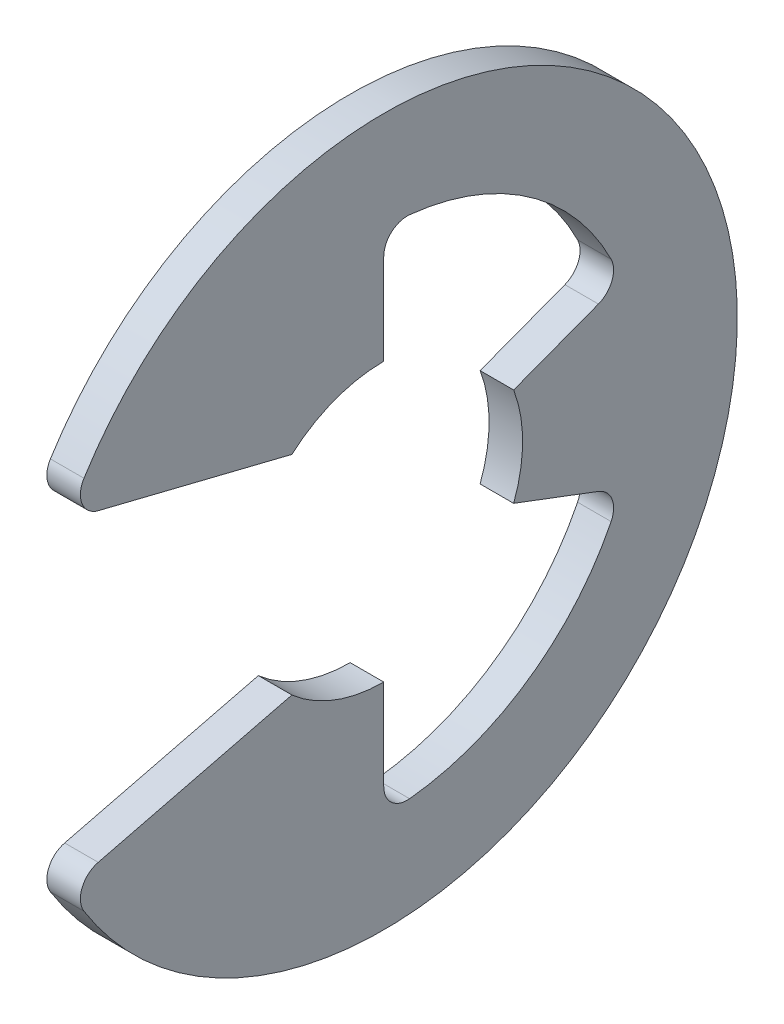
from build123d import *

# Parameters (mm, degrees)
EXTRUDE1_DEPTH = 0.3175
FILLET1_R      = 0.4445


with BuildPart() as part:
    # Sketch1 → Extrude1 (new, symmetric)
    with BuildSketch(Plane(origin=(0, 0, 0), x_dir=(0, 0, -1), z_dir=(1, 0, 0))):
        with BuildLine():
            Line((-5.971542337, -3.022514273), (-1.738853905, -1.971675))
            ThreePointArc((-1.738853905, -1.971675), (-0.929456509, -2.459110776), (0, -2.6289))
            Line((0, -2.6289), (0, -4.811251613))
            ThreePointArc((0, -4.811251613), (2.735327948, -3.958045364), (4.500513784, -1.701034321))
            Line((4.500513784, -1.701034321), (2.459110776, -0.929456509))
            ThreePointArc((2.459110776, -0.929456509), (2.6289, 0), (2.459110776, 0.929456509))
            Line((2.459110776, 0.929456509), (4.500513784, 1.701034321))
            ThreePointArc((4.500513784, 1.701034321), (2.735327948, 3.958045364), (0, 4.811251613))
            Line((0, 4.811251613), (0, 2.6289))
            ThreePointArc((0, 2.6289), (-0.929456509, 2.459110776), (-1.738853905, 1.971675))
            Line((-1.738853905, 1.971675), (-5.971542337, 3.022514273))
            ThreePointArc((-5.971542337, 3.022514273), (6.6929, 0), (-5.971542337, -3.022514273))
        make_face()
    extrude(amount=EXTRUDE1_DEPTH, both=True)

    # Fillet1
    fillet1_edges = [part.edges().sort_by_distance(p)[0] for p in [
        (0, -3.022514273, 5.971542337),
        (0, -4.811251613, 0),
        (0, -1.701034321, -4.500513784),
        (0, 1.701034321, -4.500513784),
        (0, 4.811251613, 0),
        (0, 3.022514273, 5.971542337),
    ]]
    fillet(fillet1_edges, radius=FILLET1_R)


solid = part.part
